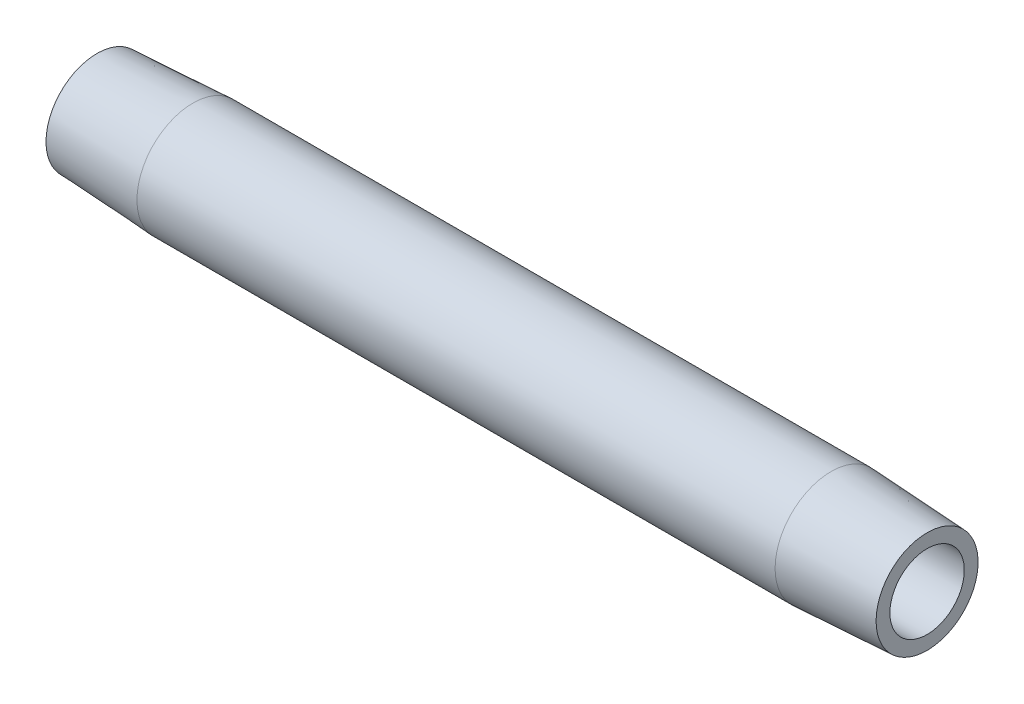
from build123d import *


with BuildPart() as part:
    # Sketch2 → Revolve1 (revolve)
    with BuildSketch(Plane.XY, mode=Mode.PRIVATE) as revolve1_sk:
        Polygon((8.810039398, 5.1435), (0, 4.6817854), (0, 3.4163), (76.2, 3.4163), (76.2, 4.6817854), (67.389960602, 5.1435), align=None)
    revolve(revolve1_sk.sketch.rotate(Axis((0.476141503, 0, 0), (1, 0, 0)), 90), axis=Axis((0.476141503, 0, 0), (1, 0, 0)))


solid = part.part
